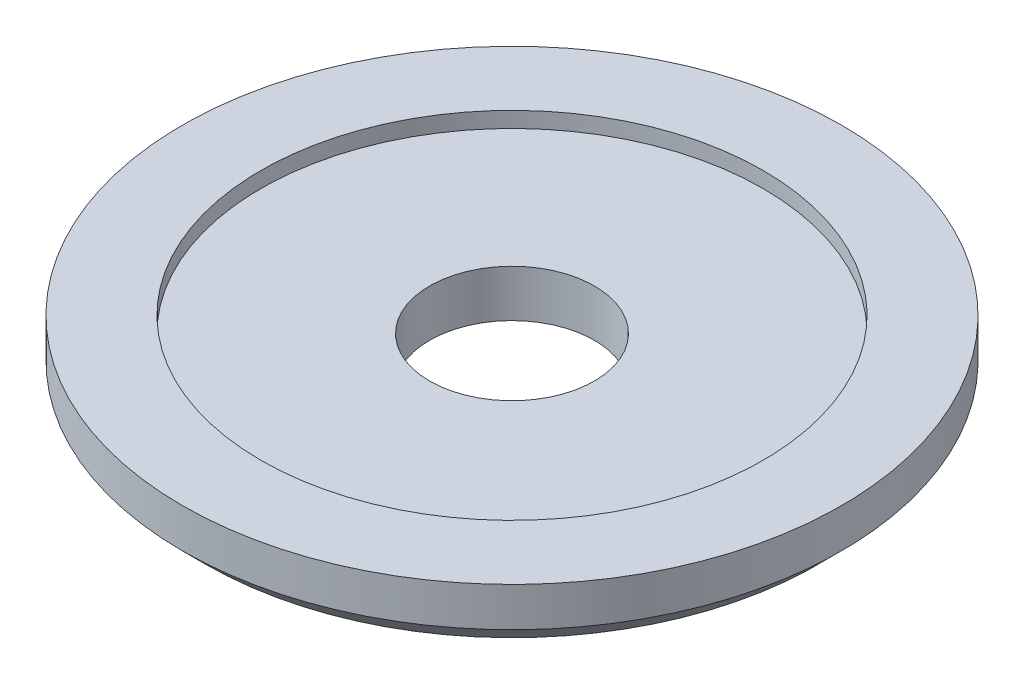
from build123d import *

# Parameters (mm, degrees)
SKETCH1_R           = 21
SKETCH1_R_2         = 5.25
BOSS_EXTRUDE1_DEPTH = 3
SKETCH2_R           = 21
SKETCH2_R_2         = 16
BOSS_EXTRUDE2_DEPTH = 1
CHAMFER1_SIZE       = 1.5


with BuildPart() as part:
    # Sketch1 → Boss-Extrude1 (new body)
    with BuildSketch(Plane(origin=(0, 0, 0), x_dir=(1, 0, 0), z_dir=(0, 1, 0))):
        with Locations(Location((0, 0, 0), (0, 0, 270))):
            Circle(SKETCH1_R)
        with Locations(Location((0, 0, 0), (0, 0, 270))):
            Circle(SKETCH1_R_2, mode=Mode.SUBTRACT)
    extrude(amount=BOSS_EXTRUDE1_DEPTH)

    # Sketch2 → Boss-Extrude2 (add)
    with BuildSketch(Plane(origin=(0, 3, 0), x_dir=(1, 0, 0), z_dir=(0, 1, 0))):
        with Locations(Location((0, 0, 0), (0, 0, 270))):
            Circle(SKETCH2_R)
        with Locations(Location((0, 0, 0), (0, 0, 270))):
            Circle(SKETCH2_R_2, mode=Mode.SUBTRACT)
    extrude(amount=BOSS_EXTRUDE2_DEPTH)

    # Chamfer1
    chamfer1_edges = [part.edges().sort_by_distance(p)[0] for p in [
        (0, 0, -21),
    ]]
    chamfer(chamfer1_edges, length=CHAMFER1_SIZE)


solid = part.part
